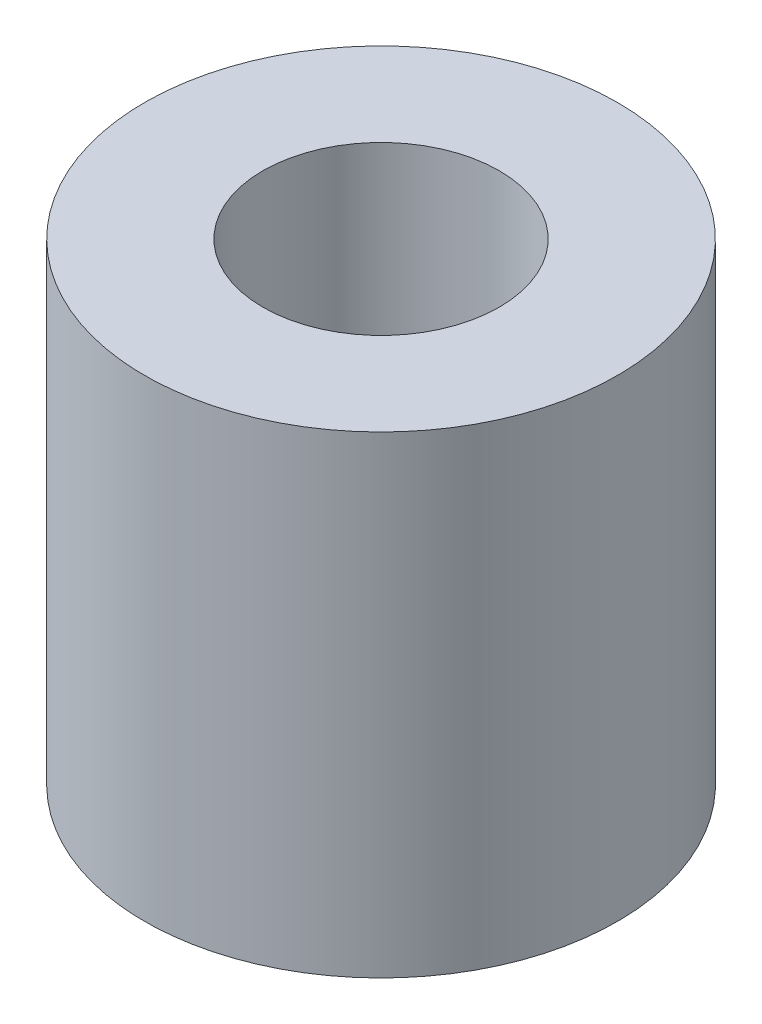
ISO-10303-21;
HEADER;
FILE_DESCRIPTION(('STEP AP214'),'2;1');
FILE_NAME('part.step','',(''),(''),'','','');
FILE_SCHEMA(('AUTOMOTIVE_DESIGN { 1 0 10303 214 1 1 1 1 }'));
ENDSEC;
DATA;
#1=APPLICATION_CONTEXT('core data for automotive mechanical design processes');
#2=APPLICATION_PROTOCOL_DEFINITION('international standard','automotive_design',2000,#1);
#3=PRODUCT_CONTEXT('',#1,'mechanical');
#4=PRODUCT('Part','Part','',(#3));
#5=PRODUCT_RELATED_PRODUCT_CATEGORY('part','',(#4));
#6=PRODUCT_DEFINITION_FORMATION('','',#4);
#7=PRODUCT_DEFINITION_CONTEXT('part definition',#1,'design');
#8=PRODUCT_DEFINITION('design','',#6,#7);
#9=PRODUCT_DEFINITION_SHAPE('','',#8);
#10=(LENGTH_UNIT() NAMED_UNIT(*) SI_UNIT(.MILLI.,.METRE.));
#11=(NAMED_UNIT(*) PLANE_ANGLE_UNIT() SI_UNIT($,.RADIAN.));
#12=(NAMED_UNIT(*) SI_UNIT($,.STERADIAN.) SOLID_ANGLE_UNIT());
#13=UNCERTAINTY_MEASURE_WITH_UNIT(LENGTH_MEASURE(1.E-05),#10,'distance_accuracy_value','');
#14=(GEOMETRIC_REPRESENTATION_CONTEXT(3) GLOBAL_UNCERTAINTY_ASSIGNED_CONTEXT((#13)) GLOBAL_UNIT_ASSIGNED_CONTEXT((#10,
#11,#12)) REPRESENTATION_CONTEXT('',''));
#15=CARTESIAN_POINT('',(0.,0.,0.));
#16=DIRECTION('',(0.,0.,1.));
#17=DIRECTION('',(1.,0.,0.));
#18=AXIS2_PLACEMENT_3D('',#15,#16,#17);
#19=CARTESIAN_POINT('',(0.,0.,0.));
#20=DIRECTION('',(0.,-1.,0.));
#21=DIRECTION('',(0.,0.,-1.));
#22=AXIS2_PLACEMENT_3D('',#19,#20,#21);
#23=CYLINDRICAL_SURFACE('',#22,2.5);
#24=CARTESIAN_POINT('',(0.,0.,0.));
#25=DIRECTION('',(0.,-1.,0.));
#26=DIRECTION('',(0.,0.,-1.));
#27=AXIS2_PLACEMENT_3D('',#24,#25,#26);
#28=CIRCLE('',#27,2.5);
#29=CARTESIAN_POINT('',(0.,0.,-2.5));
#30=VERTEX_POINT('',#29);
#31=EDGE_CURVE('E56',#30,#30,#28,.T.);
#32=ORIENTED_EDGE('',*,*,#31,.T.);
#33=EDGE_LOOP('',(#32));
#34=FACE_BOUND('',#33,.T.);
#35=CARTESIAN_POINT('',(0.,5.,0.));
#36=DIRECTION('',(0.,-1.,0.));
#37=DIRECTION('',(0.,0.,-1.));
#38=AXIS2_PLACEMENT_3D('',#35,#36,#37);
#39=CIRCLE('',#38,2.5);
#40=CARTESIAN_POINT('',(0.,5.,-2.5));
#41=VERTEX_POINT('',#40);
#42=EDGE_CURVE('E10',#41,#41,#39,.T.);
#43=ORIENTED_EDGE('',*,*,#42,.F.);
#44=EDGE_LOOP('',(#43));
#45=FACE_BOUND('',#44,.T.);
#46=ADVANCED_FACE('F34',(#34,#45),#23,.F.);
#47=CARTESIAN_POINT('',(2.5,5.,0.));
#48=DIRECTION('',(0.,1.,0.));
#49=DIRECTION('',(0.,0.,1.));
#50=AXIS2_PLACEMENT_3D('',#47,#48,#49);
#51=PLANE('',#50);
#52=ORIENTED_EDGE('',*,*,#42,.T.);
#53=EDGE_LOOP('',(#52));
#54=FACE_BOUND('',#53,.T.);
#55=CARTESIAN_POINT('',(0.,5.,0.));
#56=DIRECTION('',(0.,-1.,0.));
#57=DIRECTION('',(0.,0.,-1.));
#58=AXIS2_PLACEMENT_3D('',#55,#56,#57);
#59=CIRCLE('',#58,5.);
#60=CARTESIAN_POINT('',(0.,5.,-5.));
#61=VERTEX_POINT('',#60);
#62=EDGE_CURVE('E40',#61,#61,#59,.T.);
#63=ORIENTED_EDGE('',*,*,#62,.F.);
#64=EDGE_LOOP('',(#63));
#65=FACE_BOUND('',#64,.T.);
#66=ADVANCED_FACE('F74',(#54,#65),#51,.T.);
#67=CARTESIAN_POINT('',(0.,0.,0.));
#68=DIRECTION('',(0.,-1.,0.));
#69=DIRECTION('',(0.,0.,-1.));
#70=AXIS2_PLACEMENT_3D('',#67,#68,#69);
#71=CYLINDRICAL_SURFACE('',#70,5.);
#72=ORIENTED_EDGE('',*,*,#62,.T.);
#73=EDGE_LOOP('',(#72));
#74=FACE_BOUND('',#73,.T.);
#75=CARTESIAN_POINT('',(0.,-5.,0.));
#76=DIRECTION('',(0.,-1.,0.));
#77=DIRECTION('',(0.,0.,-1.));
#78=AXIS2_PLACEMENT_3D('',#75,#76,#77);
#79=CIRCLE('',#78,5.);
#80=CARTESIAN_POINT('',(0.,-5.,-5.));
#81=VERTEX_POINT('',#80);
#82=EDGE_CURVE('E44',#81,#81,#79,.T.);
#83=ORIENTED_EDGE('',*,*,#82,.F.);
#84=EDGE_LOOP('',(#83));
#85=FACE_BOUND('',#84,.T.);
#86=ADVANCED_FACE('F78',(#74,#85),#71,.T.);
#87=CARTESIAN_POINT('',(5.,-5.,0.));
#88=DIRECTION('',(0.,-1.,0.));
#89=DIRECTION('',(0.,0.,-1.));
#90=AXIS2_PLACEMENT_3D('',#87,#88,#89);
#91=PLANE('',#90);
#92=ORIENTED_EDGE('',*,*,#82,.T.);
#93=EDGE_LOOP('',(#92));
#94=FACE_BOUND('',#93,.T.);
#95=CARTESIAN_POINT('',(0.,-5.,0.));
#96=DIRECTION('',(0.,-1.,0.));
#97=DIRECTION('',(0.,0.,-1.));
#98=AXIS2_PLACEMENT_3D('',#95,#96,#97);
#99=CIRCLE('',#98,3.175);
#100=CARTESIAN_POINT('',(0.,-5.,-3.175));
#101=VERTEX_POINT('',#100);
#102=EDGE_CURVE('E48',#101,#101,#99,.T.);
#103=ORIENTED_EDGE('',*,*,#102,.F.);
#104=EDGE_LOOP('',(#103));
#105=FACE_BOUND('',#104,.T.);
#106=ADVANCED_FACE('F70',(#94,#105),#91,.T.);
#107=CARTESIAN_POINT('',(0.,0.,0.));
#108=DIRECTION('',(0.,-1.,0.));
#109=DIRECTION('',(0.,0.,-1.));
#110=AXIS2_PLACEMENT_3D('',#107,#108,#109);
#111=CYLINDRICAL_SURFACE('',#110,3.175);
#112=ORIENTED_EDGE('',*,*,#102,.T.);
#113=EDGE_LOOP('',(#112));
#114=FACE_BOUND('',#113,.T.);
#115=CARTESIAN_POINT('',(0.,0.,0.));
#116=DIRECTION('',(0.,-1.,0.));
#117=DIRECTION('',(0.,0.,-1.));
#118=AXIS2_PLACEMENT_3D('',#115,#116,#117);
#119=CIRCLE('',#118,3.175);
#120=CARTESIAN_POINT('',(0.,0.,-3.175));
#121=VERTEX_POINT('',#120);
#122=EDGE_CURVE('E53',#121,#121,#119,.T.);
#123=ORIENTED_EDGE('',*,*,#122,.F.);
#124=EDGE_LOOP('',(#123));
#125=FACE_BOUND('',#124,.T.);
#126=ADVANCED_FACE('F64',(#114,#125),#111,.F.);
#127=CARTESIAN_POINT('',(3.175,0.,0.));
#128=DIRECTION('',(0.,-1.,0.));
#129=DIRECTION('',(0.,0.,-1.));
#130=AXIS2_PLACEMENT_3D('',#127,#128,#129);
#131=PLANE('',#130);
#132=ORIENTED_EDGE('',*,*,#122,.T.);
#133=EDGE_LOOP('',(#132));
#134=FACE_BOUND('',#133,.T.);
#135=ORIENTED_EDGE('',*,*,#31,.F.);
#136=EDGE_LOOP('',(#135));
#137=FACE_BOUND('',#136,.T.);
#138=ADVANCED_FACE('F62',(#134,#137),#131,.T.);
#139=CLOSED_SHELL('',(#46,#66,#86,#106,#126,#138));
#140=MANIFOLD_SOLID_BREP('B2',#139);
#141=ADVANCED_BREP_SHAPE_REPRESENTATION('',(#18,#140),#14);
#142=SHAPE_DEFINITION_REPRESENTATION(#9,#141);
ENDSEC;
END-ISO-10303-21;
